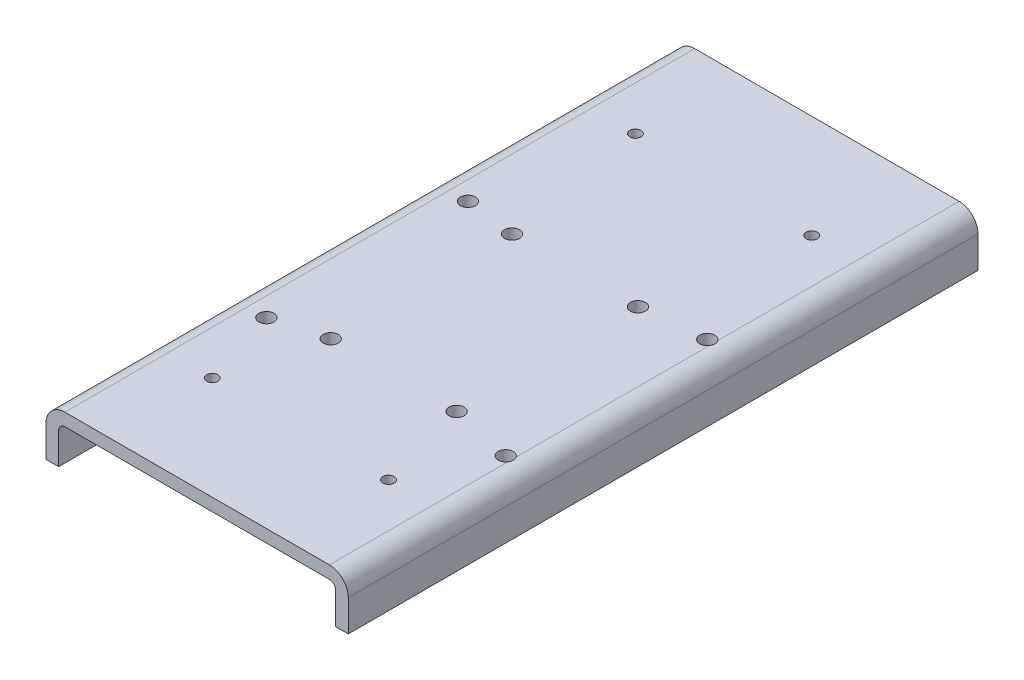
ISO-10303-21;
HEADER;
FILE_DESCRIPTION(('STEP AP214'),'2;1');
FILE_NAME('part.step','',(''),(''),'','','');
FILE_SCHEMA(('AUTOMOTIVE_DESIGN { 1 0 10303 214 1 1 1 1 }'));
ENDSEC;
DATA;
#1=APPLICATION_CONTEXT('core data for automotive mechanical design processes');
#2=APPLICATION_PROTOCOL_DEFINITION('international standard','automotive_design',2000,#1);
#3=PRODUCT_CONTEXT('',#1,'mechanical');
#4=PRODUCT('Part','Part','',(#3));
#5=PRODUCT_RELATED_PRODUCT_CATEGORY('part','',(#4));
#6=PRODUCT_DEFINITION_FORMATION('','',#4);
#7=PRODUCT_DEFINITION_CONTEXT('part definition',#1,'design');
#8=PRODUCT_DEFINITION('design','',#6,#7);
#9=PRODUCT_DEFINITION_SHAPE('','',#8);
#10=(LENGTH_UNIT() NAMED_UNIT(*) SI_UNIT(.MILLI.,.METRE.));
#11=(NAMED_UNIT(*) PLANE_ANGLE_UNIT() SI_UNIT($,.RADIAN.));
#12=(NAMED_UNIT(*) SI_UNIT($,.STERADIAN.) SOLID_ANGLE_UNIT());
#13=UNCERTAINTY_MEASURE_WITH_UNIT(LENGTH_MEASURE(1.E-05),#10,'distance_accuracy_value','');
#14=(GEOMETRIC_REPRESENTATION_CONTEXT(3) GLOBAL_UNCERTAINTY_ASSIGNED_CONTEXT((#13)) GLOBAL_UNIT_ASSIGNED_CONTEXT((#10,
#11,#12)) REPRESENTATION_CONTEXT('',''));
#15=CARTESIAN_POINT('',(0.,0.,0.));
#16=DIRECTION('',(0.,0.,1.));
#17=DIRECTION('',(1.,0.,0.));
#18=AXIS2_PLACEMENT_3D('',#15,#16,#17);
#19=CARTESIAN_POINT('',(0.,25.,500.));
#20=DIRECTION('',(1.,0.,0.));
#21=DIRECTION('',(0.,1.,0.));
#22=AXIS2_PLACEMENT_3D('',#19,#20,#21);
#23=PLANE('',#22);
#24=DIRECTION('',(0.,-1.,0.));
#25=VECTOR('',#24,1.);
#26=CARTESIAN_POINT('',(0.,25.,0.));
#27=LINE('',#26,#25);
#28=CARTESIAN_POINT('',(0.,25.,0.));
#29=VERTEX_POINT('',#28);
#30=CARTESIAN_POINT('',(0.,0.,0.));
#31=VERTEX_POINT('',#30);
#32=EDGE_CURVE('E218',#29,#31,#27,.T.);
#33=ORIENTED_EDGE('',*,*,#32,.T.);
#34=DIRECTION('',(0.,0.,-1.));
#35=VECTOR('',#34,1.);
#36=CARTESIAN_POINT('',(0.,0.,500.));
#37=LINE('',#36,#35);
#38=CARTESIAN_POINT('',(0.,0.,500.));
#39=VERTEX_POINT('',#38);
#40=EDGE_CURVE('E364',#39,#31,#37,.T.);
#41=ORIENTED_EDGE('',*,*,#40,.F.);
#42=DIRECTION('',(0.,-1.,0.));
#43=VECTOR('',#42,1.);
#44=CARTESIAN_POINT('',(0.,25.,500.));
#45=LINE('',#44,#43);
#46=CARTESIAN_POINT('',(0.,25.,500.));
#47=VERTEX_POINT('',#46);
#48=EDGE_CURVE('E192',#47,#39,#45,.T.);
#49=ORIENTED_EDGE('',*,*,#48,.F.);
#50=DIRECTION('',(0.,0.,-1.));
#51=VECTOR('',#50,1.);
#52=CARTESIAN_POINT('',(0.,25.,500.));
#53=LINE('',#52,#51);
#54=EDGE_CURVE('E164',#47,#29,#53,.T.);
#55=ORIENTED_EDGE('',*,*,#54,.T.);
#56=EDGE_LOOP('',(#33,#41,#49,#55));
#57=FACE_BOUND('',#56,.T.);
#58=ADVANCED_FACE('F24',(#57),#23,.F.);
#59=CARTESIAN_POINT('',(0.,0.,500.));
#60=DIRECTION('',(0.,1.,0.));
#61=DIRECTION('',(0.,0.,1.));
#62=AXIS2_PLACEMENT_3D('',#59,#60,#61);
#63=PLANE('',#62);
#64=DIRECTION('',(1.,0.,0.));
#65=VECTOR('',#64,1.);
#66=CARTESIAN_POINT('',(0.,0.,0.));
#67=LINE('',#66,#65);
#68=CARTESIAN_POINT('',(10.,0.,0.));
#69=VERTEX_POINT('',#68);
#70=EDGE_CURVE('E216',#31,#69,#67,.T.);
#71=ORIENTED_EDGE('',*,*,#70,.T.);
#72=DIRECTION('',(0.,0.,-1.));
#73=VECTOR('',#72,1.);
#74=CARTESIAN_POINT('',(10.,0.,500.));
#75=LINE('',#74,#73);
#76=CARTESIAN_POINT('',(10.,0.,500.));
#77=VERTEX_POINT('',#76);
#78=EDGE_CURVE('E410',#77,#69,#75,.T.);
#79=ORIENTED_EDGE('',*,*,#78,.F.);
#80=DIRECTION('',(1.,0.,0.));
#81=VECTOR('',#80,1.);
#82=CARTESIAN_POINT('',(0.,0.,500.));
#83=LINE('',#82,#81);
#84=EDGE_CURVE('E190',#39,#77,#83,.T.);
#85=ORIENTED_EDGE('',*,*,#84,.F.);
#86=ORIENTED_EDGE('',*,*,#40,.T.);
#87=EDGE_LOOP('',(#71,#79,#85,#86));
#88=FACE_BOUND('',#87,.T.);
#89=ADVANCED_FACE('F335',(#88),#63,.F.);
#90=CARTESIAN_POINT('',(10.,0.,500.));
#91=DIRECTION('',(-1.,0.,0.));
#92=DIRECTION('',(0.,0.,1.));
#93=AXIS2_PLACEMENT_3D('',#90,#91,#92);
#94=PLANE('',#93);
#95=DIRECTION('',(0.,1.,0.));
#96=VECTOR('',#95,1.);
#97=CARTESIAN_POINT('',(10.,0.,0.));
#98=LINE('',#97,#96);
#99=CARTESIAN_POINT('',(10.,25.,0.));
#100=VERTEX_POINT('',#99);
#101=EDGE_CURVE('E214',#69,#100,#98,.T.);
#102=ORIENTED_EDGE('',*,*,#101,.T.);
#103=DIRECTION('',(0.,0.,-1.));
#104=VECTOR('',#103,1.);
#105=CARTESIAN_POINT('',(10.,25.,500.));
#106=LINE('',#105,#104);
#107=CARTESIAN_POINT('',(10.,25.,500.));
#108=VERTEX_POINT('',#107);
#109=EDGE_CURVE('E407',#108,#100,#106,.T.);
#110=ORIENTED_EDGE('',*,*,#109,.F.);
#111=DIRECTION('',(0.,1.,0.));
#112=VECTOR('',#111,1.);
#113=CARTESIAN_POINT('',(10.,0.,500.));
#114=LINE('',#113,#112);
#115=EDGE_CURVE('E188',#77,#108,#114,.T.);
#116=ORIENTED_EDGE('',*,*,#115,.F.);
#117=ORIENTED_EDGE('',*,*,#78,.T.);
#118=EDGE_LOOP('',(#102,#110,#116,#117));
#119=FACE_BOUND('',#118,.T.);
#120=ADVANCED_FACE('F341',(#119),#94,.F.);
#121=CARTESIAN_POINT('',(15.,25.,500.));
#122=DIRECTION('',(0.,0.,-1.));
#123=DIRECTION('',(-1.,0.,0.));
#124=AXIS2_PLACEMENT_3D('',#121,#122,#123);
#125=CYLINDRICAL_SURFACE('',#124,5.);
#126=CARTESIAN_POINT('',(15.,25.,0.));
#127=DIRECTION('',(0.,0.,-1.));
#128=DIRECTION('',(1.,0.,0.));
#129=AXIS2_PLACEMENT_3D('',#126,#127,#128);
#130=CIRCLE('',#129,5.);
#131=CARTESIAN_POINT('',(15.,30.,0.));
#132=VERTEX_POINT('',#131);
#133=EDGE_CURVE('E212',#100,#132,#130,.T.);
#134=ORIENTED_EDGE('',*,*,#133,.T.);
#135=DIRECTION('',(0.,0.,-1.));
#136=VECTOR('',#135,1.);
#137=CARTESIAN_POINT('',(15.,30.,500.));
#138=LINE('',#137,#136);
#139=CARTESIAN_POINT('',(15.,30.,500.));
#140=VERTEX_POINT('',#139);
#141=EDGE_CURVE('E403',#140,#132,#138,.T.);
#142=ORIENTED_EDGE('',*,*,#141,.F.);
#143=CARTESIAN_POINT('',(15.,25.,500.));
#144=DIRECTION('',(0.,0.,-1.));
#145=DIRECTION('',(1.,0.,0.));
#146=AXIS2_PLACEMENT_3D('',#143,#144,#145);
#147=CIRCLE('',#146,5.);
#148=EDGE_CURVE('E186',#108,#140,#147,.T.);
#149=ORIENTED_EDGE('',*,*,#148,.F.);
#150=ORIENTED_EDGE('',*,*,#109,.T.);
#151=EDGE_LOOP('',(#134,#142,#149,#150));
#152=FACE_BOUND('',#151,.T.);
#153=ADVANCED_FACE('F422',(#152),#125,.F.);
#154=CARTESIAN_POINT('',(15.,30.,500.));
#155=DIRECTION('',(0.,1.,0.));
#156=DIRECTION('',(0.,0.,1.));
#157=AXIS2_PLACEMENT_3D('',#154,#155,#156);
#158=PLANE('',#157);
#159=CARTESIAN_POINT('',(190.000000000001,30.,417.999999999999));
#160=DIRECTION('',(0.,1.,0.));
#161=DIRECTION('',(0.,0.,1.));
#162=AXIS2_PLACEMENT_3D('',#159,#160,#161);
#163=CIRCLE('',#162,4.49999999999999);
#164=CARTESIAN_POINT('',(190.000000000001,30.,422.499999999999));
#165=VERTEX_POINT('',#164);
#166=EDGE_CURVE('E573',#165,#165,#163,.T.);
#167=ORIENTED_EDGE('',*,*,#166,.T.);
#168=EDGE_LOOP('',(#167));
#169=FACE_BOUND('',#168,.T.);
#170=CARTESIAN_POINT('',(50.0000000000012,30.,418.));
#171=DIRECTION('',(0.,1.,0.));
#172=DIRECTION('',(0.,0.,1.));
#173=AXIS2_PLACEMENT_3D('',#170,#171,#172);
#174=CIRCLE('',#173,4.5);
#175=CARTESIAN_POINT('',(50.0000000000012,30.,422.5));
#176=VERTEX_POINT('',#175);
#177=EDGE_CURVE('E577',#176,#176,#174,.T.);
#178=ORIENTED_EDGE('',*,*,#177,.T.);
#179=EDGE_LOOP('',(#178));
#180=FACE_BOUND('',#179,.T.);
#181=CARTESIAN_POINT('',(190.,30.,81.999999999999));
#182=DIRECTION('',(0.,1.,0.));
#183=DIRECTION('',(0.,0.,1.));
#184=AXIS2_PLACEMENT_3D('',#181,#182,#183);
#185=CIRCLE('',#184,4.49999999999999);
#186=CARTESIAN_POINT('',(190.,30.,86.499999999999));
#187=VERTEX_POINT('',#186);
#188=EDGE_CURVE('E581',#187,#187,#185,.T.);
#189=ORIENTED_EDGE('',*,*,#188,.T.);
#190=EDGE_LOOP('',(#189));
#191=FACE_BOUND('',#190,.T.);
#192=CARTESIAN_POINT('',(50.,30.,82.));
#193=DIRECTION('',(0.,1.,0.));
#194=DIRECTION('',(0.,0.,1.));
#195=AXIS2_PLACEMENT_3D('',#192,#193,#194);
#196=CIRCLE('',#195,4.5);
#197=CARTESIAN_POINT('',(50.,30.,86.5));
#198=VERTEX_POINT('',#197);
#199=EDGE_CURVE('E146',#198,#198,#196,.T.);
#200=ORIENTED_EDGE('',*,*,#199,.T.);
#201=EDGE_LOOP('',(#200));
#202=FACE_BOUND('',#201,.T.);
#203=CARTESIAN_POINT('',(30.,30.,355.));
#204=DIRECTION('',(0.,1.,0.));
#205=DIRECTION('',(0.,0.,1.));
#206=AXIS2_PLACEMENT_3D('',#203,#204,#205);
#207=CIRCLE('',#206,5.99999999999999);
#208=CARTESIAN_POINT('',(30.,30.,361.));
#209=VERTEX_POINT('',#208);
#210=EDGE_CURVE('E546',#209,#209,#207,.T.);
#211=ORIENTED_EDGE('',*,*,#210,.T.);
#212=EDGE_LOOP('',(#211));
#213=FACE_BOUND('',#212,.T.);
#214=CARTESIAN_POINT('',(30.,30.,195.));
#215=DIRECTION('',(0.,1.,0.));
#216=DIRECTION('',(0.,0.,1.));
#217=AXIS2_PLACEMENT_3D('',#214,#215,#216);
#218=CIRCLE('',#217,5.99999999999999);
#219=CARTESIAN_POINT('',(30.,30.,201.));
#220=VERTEX_POINT('',#219);
#221=EDGE_CURVE('E233',#220,#220,#218,.T.);
#222=ORIENTED_EDGE('',*,*,#221,.T.);
#223=EDGE_LOOP('',(#222));
#224=FACE_BOUND('',#223,.T.);
#225=CARTESIAN_POINT('',(70.,30.,200.));
#226=DIRECTION('',(0.,1.,0.));
#227=DIRECTION('',(0.,0.,1.));
#228=AXIS2_PLACEMENT_3D('',#225,#226,#227);
#229=CIRCLE('',#228,6.00000000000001);
#230=CARTESIAN_POINT('',(70.,30.,206.));
#231=VERTEX_POINT('',#230);
#232=EDGE_CURVE('E227',#231,#231,#229,.T.);
#233=ORIENTED_EDGE('',*,*,#232,.T.);
#234=EDGE_LOOP('',(#233));
#235=FACE_BOUND('',#234,.T.);
#236=CARTESIAN_POINT('',(170.,30.,200.));
#237=DIRECTION('',(0.,1.,0.));
#238=DIRECTION('',(0.,0.,1.));
#239=AXIS2_PLACEMENT_3D('',#236,#237,#238);
#240=CIRCLE('',#239,6.00000000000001);
#241=CARTESIAN_POINT('',(170.,30.,206.));
#242=VERTEX_POINT('',#241);
#243=EDGE_CURVE('E221',#242,#242,#240,.T.);
#244=ORIENTED_EDGE('',*,*,#243,.T.);
#245=EDGE_LOOP('',(#244));
#246=FACE_BOUND('',#245,.T.);
#247=DIRECTION('',(0.,0.,-1.));
#248=VECTOR('',#247,1.);
#249=CARTESIAN_POINT('',(225.,30.,500.));
#250=LINE('',#249,#248);
#251=CARTESIAN_POINT('',(225.,30.,351.683375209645));
#252=VERTEX_POINT('',#251);
#253=CARTESIAN_POINT('',(225.,30.,198.316624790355));
#254=VERTEX_POINT('',#253);
#255=EDGE_CURVE('E404',#252,#254,#250,.T.);
#256=ORIENTED_EDGE('',*,*,#255,.F.);
#257=CARTESIAN_POINT('',(220.,30.,355.));
#258=DIRECTION('',(0.,1.,0.));
#259=DIRECTION('',(0.,0.,1.));
#260=AXIS2_PLACEMENT_3D('',#257,#258,#259);
#261=CIRCLE('',#260,6.00000000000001);
#262=CARTESIAN_POINT('',(225.,30.,358.316624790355));
#263=VERTEX_POINT('',#262);
#264=EDGE_CURVE('E38',#252,#263,#261,.T.);
#265=ORIENTED_EDGE('',*,*,#264,.T.);
#266=CARTESIAN_POINT('',(225.,30.,500.));
#267=VERTEX_POINT('',#266);
#268=EDGE_CURVE('E400',#267,#263,#250,.T.);
#269=ORIENTED_EDGE('',*,*,#268,.F.);
#270=DIRECTION('',(1.,0.,0.));
#271=VECTOR('',#270,1.);
#272=CARTESIAN_POINT('',(15.,30.,500.));
#273=LINE('',#272,#271);
#274=EDGE_CURVE('E184',#140,#267,#273,.T.);
#275=ORIENTED_EDGE('',*,*,#274,.F.);
#276=ORIENTED_EDGE('',*,*,#141,.T.);
#277=DIRECTION('',(1.,0.,0.));
#278=VECTOR('',#277,1.);
#279=CARTESIAN_POINT('',(15.,30.,0.));
#280=LINE('',#279,#278);
#281=CARTESIAN_POINT('',(225.,30.,0.));
#282=VERTEX_POINT('',#281);
#283=EDGE_CURVE('E209',#132,#282,#280,.T.);
#284=ORIENTED_EDGE('',*,*,#283,.T.);
#285=CARTESIAN_POINT('',(225.,30.,191.683375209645));
#286=VERTEX_POINT('',#285);
#287=EDGE_CURVE('E396',#286,#282,#250,.T.);
#288=ORIENTED_EDGE('',*,*,#287,.F.);
#289=CARTESIAN_POINT('',(220.,30.,195.));
#290=DIRECTION('',(0.,1.,0.));
#291=DIRECTION('',(0.,0.,1.));
#292=AXIS2_PLACEMENT_3D('',#289,#290,#291);
#293=CIRCLE('',#292,6.00000000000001);
#294=EDGE_CURVE('E239',#286,#254,#293,.T.);
#295=ORIENTED_EDGE('',*,*,#294,.T.);
#296=EDGE_LOOP('',(#256,#265,#269,#275,#276,#284,#288,#295));
#297=FACE_BOUND('',#296,.T.);
#298=CARTESIAN_POINT('',(170.,30.,344.));
#299=DIRECTION('',(0.,1.,0.));
#300=DIRECTION('',(0.,0.,1.));
#301=AXIS2_PLACEMENT_3D('',#298,#299,#300);
#302=CIRCLE('',#301,6.00000000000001);
#303=CARTESIAN_POINT('',(170.,30.,350.));
#304=VERTEX_POINT('',#303);
#305=EDGE_CURVE('E357',#304,#304,#302,.T.);
#306=ORIENTED_EDGE('',*,*,#305,.T.);
#307=EDGE_LOOP('',(#306));
#308=FACE_BOUND('',#307,.T.);
#309=CARTESIAN_POINT('',(70.,30.,344.));
#310=DIRECTION('',(0.,1.,0.));
#311=DIRECTION('',(0.,0.,1.));
#312=AXIS2_PLACEMENT_3D('',#309,#310,#311);
#313=CIRCLE('',#312,6.00000000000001);
#314=CARTESIAN_POINT('',(70.,30.,350.));
#315=VERTEX_POINT('',#314);
#316=EDGE_CURVE('E362',#315,#315,#313,.T.);
#317=ORIENTED_EDGE('',*,*,#316,.T.);
#318=EDGE_LOOP('',(#317));
#319=FACE_BOUND('',#318,.T.);
#320=ADVANCED_FACE('F430',(#169,#180,#191,#202,#213,#224,#235,#246,#297,#308,#319),#158,.F.);
#321=CARTESIAN_POINT('',(225.,25.,500.));
#322=DIRECTION('',(0.,0.,-1.));
#323=DIRECTION('',(-1.,0.,0.));
#324=AXIS2_PLACEMENT_3D('',#321,#322,#323);
#325=CYLINDRICAL_SURFACE('',#324,5.);
#326=ORIENTED_EDGE('',*,*,#268,.T.);
#327=CARTESIAN_POINT('',(225.,30.,358.316624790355));
#328=CARTESIAN_POINT('',(225.092810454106,29.9999685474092,358.176739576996));
#329=CARTESIAN_POINT('',(225.179696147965,29.9974149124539,358.032978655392));
#330=CARTESIAN_POINT('',(225.341074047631,29.9890158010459,357.738797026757));
#331=CARTESIAN_POINT('',(225.415569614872,29.9831712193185,357.588378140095));
#332=CARTESIAN_POINT('',(225.551676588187,29.969940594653,357.281889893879));
#333=CARTESIAN_POINT('',(225.613287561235,29.9625544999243,357.125820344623));
#334=CARTESIAN_POINT('',(225.723231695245,29.9477288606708,356.809066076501));
#335=CARTESIAN_POINT('',(225.771564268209,29.9402893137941,356.648381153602));
#336=CARTESIAN_POINT('',(225.854622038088,29.926600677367,356.323451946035));
#337=CARTESIAN_POINT('',(225.88934502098,29.920351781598,356.159207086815));
#338=CARTESIAN_POINT('',(225.944916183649,29.9099831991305,355.82831945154));
#339=CARTESIAN_POINT('',(225.965764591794,29.9058634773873,355.661676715));
#340=CARTESIAN_POINT('',(225.993415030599,29.9003394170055,355.327273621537));
#341=CARTESIAN_POINT('',(226.000224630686,29.8989336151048,355.15951391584));
#342=CARTESIAN_POINT('',(225.999764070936,29.8990276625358,354.824019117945));
#343=CARTESIAN_POINT('',(225.992494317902,29.9005274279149,354.656284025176));
#344=CARTESIAN_POINT('',(225.964060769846,29.9061994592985,354.323523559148));
#345=CARTESIAN_POINT('',(225.943019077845,29.910348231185,354.158487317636));
#346=CARTESIAN_POINT('',(225.887321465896,29.9207175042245,353.830780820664));
#347=CARTESIAN_POINT('',(225.852664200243,29.9269382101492,353.66811080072));
#348=CARTESIAN_POINT('',(225.769999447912,29.9405317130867,353.34630889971));
#349=CARTESIAN_POINT('',(225.721996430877,29.947904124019,353.187175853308));
#350=CARTESIAN_POINT('',(225.612978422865,29.9625873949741,352.873491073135));
#351=CARTESIAN_POINT('',(225.551967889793,29.9698982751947,352.718937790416));
#352=CARTESIAN_POINT('',(225.416403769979,29.9831041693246,352.413328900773));
#353=CARTESIAN_POINT('',(225.341679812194,29.9889789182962,352.262347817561));
#354=CARTESIAN_POINT('',(225.179934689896,29.9974077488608,351.967415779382));
#355=CARTESIAN_POINT('',(225.092937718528,29.999968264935,351.823451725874));
#356=CARTESIAN_POINT('',(225.,30.,351.683375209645));
#357=B_SPLINE_CURVE_WITH_KNOTS('',3,(#327,#328,#329,#330,#331,#332,#333,#334,#335,#336,#337,
#338,#339,#340,#341,#342,#343,#344,#345,#346,#347,#348,#349,#350,#351,#352,#353,#354,#355,#356),
.UNSPECIFIED.,.F.,.F.,(4,2,2,2,2,2,2,2,2,2,2,2,2,2,4),(0.,0.503392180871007,1.00664756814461,
1.50991986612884,2.01321444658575,2.51659086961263,3.01995900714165,3.52305566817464,
4.02613779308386,4.52481889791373,5.02354930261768,5.52211287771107,6.02050586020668,
6.52557099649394,7.02965408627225),.UNSPECIFIED.);
#358=EDGE_CURVE('E145',#263,#252,#357,.T.);
#359=ORIENTED_EDGE('',*,*,#358,.T.);
#360=ORIENTED_EDGE('',*,*,#255,.T.);
#361=CARTESIAN_POINT('',(225.,30.,198.316624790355));
#362=CARTESIAN_POINT('',(225.092810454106,29.9999685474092,198.176739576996));
#363=CARTESIAN_POINT('',(225.179696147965,29.9974149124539,198.032978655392));
#364=CARTESIAN_POINT('',(225.341074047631,29.9890158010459,197.738797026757));
#365=CARTESIAN_POINT('',(225.415569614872,29.9831712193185,197.588378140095));
#366=CARTESIAN_POINT('',(225.551676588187,29.969940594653,197.281889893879));
#367=CARTESIAN_POINT('',(225.613287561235,29.9625544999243,197.125820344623));
#368=CARTESIAN_POINT('',(225.723231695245,29.9477288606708,196.809066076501));
#369=CARTESIAN_POINT('',(225.771564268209,29.9402893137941,196.648381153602));
#370=CARTESIAN_POINT('',(225.854622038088,29.926600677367,196.323451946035));
#371=CARTESIAN_POINT('',(225.88934502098,29.920351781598,196.159207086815));
#372=CARTESIAN_POINT('',(225.944916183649,29.9099831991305,195.82831945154));
#373=CARTESIAN_POINT('',(225.965764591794,29.9058634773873,195.661676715));
#374=CARTESIAN_POINT('',(225.993415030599,29.9003394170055,195.327273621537));
#375=CARTESIAN_POINT('',(226.000224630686,29.8989336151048,195.15951391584));
#376=CARTESIAN_POINT('',(225.999764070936,29.8990276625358,194.824019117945));
#377=CARTESIAN_POINT('',(225.992494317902,29.9005274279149,194.656284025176));
#378=CARTESIAN_POINT('',(225.964060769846,29.9061994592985,194.323523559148));
#379=CARTESIAN_POINT('',(225.943019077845,29.910348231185,194.158487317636));
#380=CARTESIAN_POINT('',(225.887321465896,29.9207175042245,193.830780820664));
#381=CARTESIAN_POINT('',(225.852664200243,29.9269382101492,193.66811080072));
#382=CARTESIAN_POINT('',(225.769999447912,29.9405317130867,193.34630889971));
#383=CARTESIAN_POINT('',(225.721996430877,29.947904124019,193.187175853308));
#384=CARTESIAN_POINT('',(225.612978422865,29.9625873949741,192.873491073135));
#385=CARTESIAN_POINT('',(225.551967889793,29.9698982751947,192.718937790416));
#386=CARTESIAN_POINT('',(225.416403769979,29.9831041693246,192.413328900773));
#387=CARTESIAN_POINT('',(225.341679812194,29.9889789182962,192.262347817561));
#388=CARTESIAN_POINT('',(225.179934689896,29.9974077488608,191.967415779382));
#389=CARTESIAN_POINT('',(225.092937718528,29.999968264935,191.823451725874));
#390=CARTESIAN_POINT('',(225.,30.,191.683375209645));
#391=B_SPLINE_CURVE_WITH_KNOTS('',3,(#361,#362,#363,#364,#365,#366,#367,#368,#369,#370,#371,
#372,#373,#374,#375,#376,#377,#378,#379,#380,#381,#382,#383,#384,#385,#386,#387,#388,#389,#390),
.UNSPECIFIED.,.F.,.F.,(4,2,2,2,2,2,2,2,2,2,2,2,2,2,4),(0.,0.503392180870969,1.00664756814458,
1.50991986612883,2.01321444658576,2.51659086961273,3.01995900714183,3.52305566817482,
4.02613779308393,4.52481889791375,5.02354930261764,5.52211287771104,6.02050586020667,
6.52557099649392,7.02965408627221),.UNSPECIFIED.);
#392=EDGE_CURVE('E242',#254,#286,#391,.T.);
#393=ORIENTED_EDGE('',*,*,#392,.T.);
#394=ORIENTED_EDGE('',*,*,#287,.T.);
#395=CARTESIAN_POINT('',(225.,25.,0.));
#396=DIRECTION('',(0.,0.,-1.));
#397=DIRECTION('',(-1.,0.,0.));
#398=AXIS2_PLACEMENT_3D('',#395,#396,#397);
#399=CIRCLE('',#398,5.);
#400=CARTESIAN_POINT('',(230.,25.,0.));
#401=VERTEX_POINT('',#400);
#402=EDGE_CURVE('E207',#282,#401,#399,.T.);
#403=ORIENTED_EDGE('',*,*,#402,.T.);
#404=DIRECTION('',(0.,0.,-1.));
#405=VECTOR('',#404,1.);
#406=CARTESIAN_POINT('',(230.,25.,500.));
#407=LINE('',#406,#405);
#408=CARTESIAN_POINT('',(230.,25.,500.));
#409=VERTEX_POINT('',#408);
#410=EDGE_CURVE('E393',#409,#401,#407,.T.);
#411=ORIENTED_EDGE('',*,*,#410,.F.);
#412=CARTESIAN_POINT('',(225.,25.,500.));
#413=DIRECTION('',(0.,0.,-1.));
#414=DIRECTION('',(-1.,0.,0.));
#415=AXIS2_PLACEMENT_3D('',#412,#413,#414);
#416=CIRCLE('',#415,5.);
#417=EDGE_CURVE('E182',#267,#409,#416,.T.);
#418=ORIENTED_EDGE('',*,*,#417,.F.);
#419=EDGE_LOOP('',(#326,#359,#360,#393,#394,#403,#411,#418));
#420=FACE_BOUND('',#419,.T.);
#421=ADVANCED_FACE('F256',(#420),#325,.F.);
#422=CARTESIAN_POINT('',(230.,25.,500.));
#423=DIRECTION('',(1.,0.,0.));
#424=DIRECTION('',(0.,0.,-1.));
#425=AXIS2_PLACEMENT_3D('',#422,#423,#424);
#426=PLANE('',#425);
#427=DIRECTION('',(0.,-1.,0.));
#428=VECTOR('',#427,1.);
#429=CARTESIAN_POINT('',(230.,25.,0.));
#430=LINE('',#429,#428);
#431=CARTESIAN_POINT('',(230.,0.,0.));
#432=VERTEX_POINT('',#431);
#433=EDGE_CURVE('E205',#401,#432,#430,.T.);
#434=ORIENTED_EDGE('',*,*,#433,.T.);
#435=DIRECTION('',(0.,0.,-1.));
#436=VECTOR('',#435,1.);
#437=CARTESIAN_POINT('',(230.,0.,500.));
#438=LINE('',#437,#436);
#439=CARTESIAN_POINT('',(230.,0.,500.));
#440=VERTEX_POINT('',#439);
#441=EDGE_CURVE('E390',#440,#432,#438,.T.);
#442=ORIENTED_EDGE('',*,*,#441,.F.);
#443=DIRECTION('',(0.,-1.,0.));
#444=VECTOR('',#443,1.);
#445=CARTESIAN_POINT('',(230.,25.,500.));
#446=LINE('',#445,#444);
#447=EDGE_CURVE('E180',#409,#440,#446,.T.);
#448=ORIENTED_EDGE('',*,*,#447,.F.);
#449=ORIENTED_EDGE('',*,*,#410,.T.);
#450=EDGE_LOOP('',(#434,#442,#448,#449));
#451=FACE_BOUND('',#450,.T.);
#452=ADVANCED_FACE('F432',(#451),#426,.F.);
#453=CARTESIAN_POINT('',(230.,0.,500.));
#454=DIRECTION('',(0.,1.,0.));
#455=DIRECTION('',(0.,0.,1.));
#456=AXIS2_PLACEMENT_3D('',#453,#454,#455);
#457=PLANE('',#456);
#458=DIRECTION('',(1.,0.,0.));
#459=VECTOR('',#458,1.);
#460=CARTESIAN_POINT('',(230.,0.,0.));
#461=LINE('',#460,#459);
#462=CARTESIAN_POINT('',(240.,0.,0.));
#463=VERTEX_POINT('',#462);
#464=EDGE_CURVE('E203',#432,#463,#461,.T.);
#465=ORIENTED_EDGE('',*,*,#464,.T.);
#466=DIRECTION('',(0.,0.,-1.));
#467=VECTOR('',#466,1.);
#468=CARTESIAN_POINT('',(240.,0.,500.));
#469=LINE('',#468,#467);
#470=CARTESIAN_POINT('',(240.,0.,500.));
#471=VERTEX_POINT('',#470);
#472=EDGE_CURVE('E156',#471,#463,#469,.T.);
#473=ORIENTED_EDGE('',*,*,#472,.F.);
#474=DIRECTION('',(1.,0.,0.));
#475=VECTOR('',#474,1.);
#476=CARTESIAN_POINT('',(230.,0.,500.));
#477=LINE('',#476,#475);
#478=EDGE_CURVE('E178',#440,#471,#477,.T.);
#479=ORIENTED_EDGE('',*,*,#478,.F.);
#480=ORIENTED_EDGE('',*,*,#441,.T.);
#481=EDGE_LOOP('',(#465,#473,#479,#480));
#482=FACE_BOUND('',#481,.T.);
#483=ADVANCED_FACE('F388',(#482),#457,.F.);
#484=CARTESIAN_POINT('',(240.,0.,500.));
#485=DIRECTION('',(-1.,0.,0.));
#486=DIRECTION('',(0.,0.,1.));
#487=AXIS2_PLACEMENT_3D('',#484,#485,#486);
#488=PLANE('',#487);
#489=DIRECTION('',(0.,1.,0.));
#490=VECTOR('',#489,1.);
#491=CARTESIAN_POINT('',(240.,0.,0.));
#492=LINE('',#491,#490);
#493=CARTESIAN_POINT('',(240.,25.,0.));
#494=VERTEX_POINT('',#493);
#495=EDGE_CURVE('E201',#463,#494,#492,.T.);
#496=ORIENTED_EDGE('',*,*,#495,.T.);
#497=DIRECTION('',(0.,0.,-1.));
#498=VECTOR('',#497,1.);
#499=CARTESIAN_POINT('',(240.,25.,500.));
#500=LINE('',#499,#498);
#501=CARTESIAN_POINT('',(240.,25.,500.));
#502=VERTEX_POINT('',#501);
#503=EDGE_CURVE('E152',#502,#494,#500,.T.);
#504=ORIENTED_EDGE('',*,*,#503,.F.);
#505=DIRECTION('',(0.,1.,0.));
#506=VECTOR('',#505,1.);
#507=CARTESIAN_POINT('',(240.,0.,500.));
#508=LINE('',#507,#506);
#509=EDGE_CURVE('E176',#471,#502,#508,.T.);
#510=ORIENTED_EDGE('',*,*,#509,.F.);
#511=ORIENTED_EDGE('',*,*,#472,.T.);
#512=EDGE_LOOP('',(#496,#504,#510,#511));
#513=FACE_BOUND('',#512,.T.);
#514=ADVANCED_FACE('F298',(#513),#488,.F.);
#515=CARTESIAN_POINT('',(225.,25.,500.));
#516=DIRECTION('',(0.,0.,-1.));
#517=DIRECTION('',(-1.,0.,0.));
#518=AXIS2_PLACEMENT_3D('',#515,#516,#517);
#519=CYLINDRICAL_SURFACE('',#518,15.);
#520=DIRECTION('',(0.,0.,-1.));
#521=VECTOR('',#520,1.);
#522=CARTESIAN_POINT('',(225.,40.,500.));
#523=LINE('',#522,#521);
#524=CARTESIAN_POINT('',(225.,40.,351.683375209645));
#525=VERTEX_POINT('',#524);
#526=CARTESIAN_POINT('',(225.,40.,198.316624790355));
#527=VERTEX_POINT('',#526);
#528=EDGE_CURVE('E144',#525,#527,#523,.T.);
#529=ORIENTED_EDGE('',*,*,#528,.F.);
#530=CARTESIAN_POINT('',(225.,40.,351.683375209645));
#531=CARTESIAN_POINT('',(225.093258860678,39.999989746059,351.823935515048));
#532=CARTESIAN_POINT('',(225.180556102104,39.9991295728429,351.968441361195));
#533=CARTESIAN_POINT('',(225.34267327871,39.9963072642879,352.264267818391));
#534=CARTESIAN_POINT('',(225.417494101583,39.9943452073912,352.415587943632));
#535=CARTESIAN_POINT('',(225.55407042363,39.9899183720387,352.723880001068));
#536=CARTESIAN_POINT('',(225.615834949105,39.9874539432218,352.880847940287));
#537=CARTESIAN_POINT('',(225.725934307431,39.9825252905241,353.199423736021));
#538=CARTESIAN_POINT('',(225.774269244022,39.9800610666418,353.361031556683));
#539=CARTESIAN_POINT('',(225.857174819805,39.9755459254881,353.687780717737));
#540=CARTESIAN_POINT('',(225.891742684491,39.9734950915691,353.852922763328));
#541=CARTESIAN_POINT('',(225.946863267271,39.9701107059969,354.185595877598));
#542=CARTESIAN_POINT('',(225.967411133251,39.968777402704,354.353127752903));
#543=CARTESIAN_POINT('',(225.994321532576,39.9670139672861,354.689296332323));
#544=CARTESIAN_POINT('',(226.000687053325,39.9665836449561,354.857932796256));
#545=CARTESIAN_POINT('',(225.999195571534,39.9666832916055,355.195142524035));
#546=CARTESIAN_POINT('',(225.991338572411,39.9672132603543,355.363715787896));
#547=CARTESIAN_POINT('',(225.961467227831,39.9691617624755,355.699502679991));
#548=CARTESIAN_POINT('',(225.939460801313,39.970579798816,355.866717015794));
#549=CARTESIAN_POINT('',(225.881466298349,39.9741062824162,356.198635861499));
#550=CARTESIAN_POINT('',(225.845483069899,39.9762144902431,356.363341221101));
#551=CARTESIAN_POINT('',(225.759811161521,39.9808052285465,356.68905878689));
#552=CARTESIAN_POINT('',(225.710128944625,39.9832875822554,356.850072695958));
#553=CARTESIAN_POINT('',(225.597423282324,39.9882039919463,357.167297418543));
#554=CARTESIAN_POINT('',(225.534404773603,39.9906380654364,357.323509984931));
#555=CARTESIAN_POINT('',(225.398754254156,39.9948454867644,357.622811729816));
#556=CARTESIAN_POINT('',(225.326720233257,39.9966447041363,357.766171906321));
#557=CARTESIAN_POINT('',(225.171563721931,39.9992169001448,358.046403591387));
#558=CARTESIAN_POINT('',(225.088463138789,39.999991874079,358.183287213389));
#559=CARTESIAN_POINT('',(225.,40.,358.316624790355));
#560=B_SPLINE_CURVE_WITH_KNOTS('',3,(#530,#531,#532,#533,#534,#535,#536,#537,#538,#539,#540,
#541,#542,#543,#544,#545,#546,#547,#548,#549,#550,#551,#552,#553,#554,#555,#556,#557,#558,#559),
.UNSPECIFIED.,.F.,.F.,(4,2,2,2,2,2,2,2,2,2,2,2,2,2,4),(0.,0.505889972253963,1.01174393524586,
1.51724703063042,2.02274622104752,2.52834723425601,3.03412313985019,3.53979249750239,
4.04546173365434,4.5508482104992,5.05605954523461,5.56103293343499,6.06581972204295,
6.54665622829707,7.02655464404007),.UNSPECIFIED.);
#561=CARTESIAN_POINT('',(225.,40.,358.316624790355));
#562=VERTEX_POINT('',#561);
#563=EDGE_CURVE('E45',#525,#562,#560,.T.);
#564=ORIENTED_EDGE('',*,*,#563,.T.);
#565=CARTESIAN_POINT('',(225.,40.,500.));
#566=VERTEX_POINT('',#565);
#567=EDGE_CURVE('E141',#566,#562,#523,.T.);
#568=ORIENTED_EDGE('',*,*,#567,.F.);
#569=CARTESIAN_POINT('',(225.,25.,500.));
#570=DIRECTION('',(0.,0.,1.));
#571=DIRECTION('',(1.,0.,0.));
#572=AXIS2_PLACEMENT_3D('',#569,#570,#571);
#573=CIRCLE('',#572,15.);
#574=EDGE_CURVE('E174',#502,#566,#573,.T.);
#575=ORIENTED_EDGE('',*,*,#574,.F.);
#576=ORIENTED_EDGE('',*,*,#503,.T.);
#577=CARTESIAN_POINT('',(225.,25.,0.));
#578=DIRECTION('',(0.,0.,1.));
#579=DIRECTION('',(1.,0.,0.));
#580=AXIS2_PLACEMENT_3D('',#577,#578,#579);
#581=CIRCLE('',#580,15.);
#582=CARTESIAN_POINT('',(225.,40.,0.));
#583=VERTEX_POINT('',#582);
#584=EDGE_CURVE('E199',#494,#583,#581,.T.);
#585=ORIENTED_EDGE('',*,*,#584,.T.);
#586=CARTESIAN_POINT('',(225.,40.,191.683375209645));
#587=VERTEX_POINT('',#586);
#588=EDGE_CURVE('E154',#587,#583,#523,.T.);
#589=ORIENTED_EDGE('',*,*,#588,.F.);
#590=CARTESIAN_POINT('',(225.,40.,191.683375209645));
#591=CARTESIAN_POINT('',(225.093258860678,39.999989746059,191.823935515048));
#592=CARTESIAN_POINT('',(225.180556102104,39.9991295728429,191.968441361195));
#593=CARTESIAN_POINT('',(225.34267327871,39.9963072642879,192.264267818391));
#594=CARTESIAN_POINT('',(225.417494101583,39.9943452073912,192.415587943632));
#595=CARTESIAN_POINT('',(225.55407042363,39.9899183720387,192.723880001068));
#596=CARTESIAN_POINT('',(225.615834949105,39.9874539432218,192.880847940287));
#597=CARTESIAN_POINT('',(225.725934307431,39.9825252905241,193.199423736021));
#598=CARTESIAN_POINT('',(225.774269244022,39.9800610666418,193.361031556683));
#599=CARTESIAN_POINT('',(225.857174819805,39.9755459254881,193.687780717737));
#600=CARTESIAN_POINT('',(225.891742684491,39.9734950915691,193.852922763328));
#601=CARTESIAN_POINT('',(225.946863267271,39.9701107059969,194.185595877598));
#602=CARTESIAN_POINT('',(225.967411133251,39.968777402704,194.353127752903));
#603=CARTESIAN_POINT('',(225.994321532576,39.9670139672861,194.689296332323));
#604=CARTESIAN_POINT('',(226.000687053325,39.9665836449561,194.857932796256));
#605=CARTESIAN_POINT('',(225.999195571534,39.9666832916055,195.195142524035));
#606=CARTESIAN_POINT('',(225.991338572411,39.9672132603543,195.363715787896));
#607=CARTESIAN_POINT('',(225.961467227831,39.9691617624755,195.699502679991));
#608=CARTESIAN_POINT('',(225.939460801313,39.970579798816,195.866717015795));
#609=CARTESIAN_POINT('',(225.881466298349,39.9741062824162,196.198635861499));
#610=CARTESIAN_POINT('',(225.845483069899,39.9762144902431,196.363341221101));
#611=CARTESIAN_POINT('',(225.759811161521,39.9808052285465,196.68905878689));
#612=CARTESIAN_POINT('',(225.710128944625,39.9832875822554,196.850072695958));
#613=CARTESIAN_POINT('',(225.597423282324,39.9882039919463,197.167297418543));
#614=CARTESIAN_POINT('',(225.534404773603,39.9906380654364,197.323509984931));
#615=CARTESIAN_POINT('',(225.398754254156,39.9948454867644,197.622811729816));
#616=CARTESIAN_POINT('',(225.326720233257,39.9966447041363,197.766171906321));
#617=CARTESIAN_POINT('',(225.171563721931,39.9992169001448,198.046403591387));
#618=CARTESIAN_POINT('',(225.088463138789,39.999991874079,198.183287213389));
#619=CARTESIAN_POINT('',(225.,40.,198.316624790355));
#620=B_SPLINE_CURVE_WITH_KNOTS('',3,(#590,#591,#592,#593,#594,#595,#596,#597,#598,#599,#600,
#601,#602,#603,#604,#605,#606,#607,#608,#609,#610,#611,#612,#613,#614,#615,#616,#617,#618,#619),
.UNSPECIFIED.,.F.,.F.,(4,2,2,2,2,2,2,2,2,2,2,2,2,2,4),(0.,0.505889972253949,1.01174393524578,
1.5172470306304,2.02274622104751,2.528347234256,3.03412313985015,3.53979249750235,
4.04546173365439,4.55084821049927,5.05605954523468,5.56103293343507,6.065819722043,
6.5466562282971,7.02655464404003),.UNSPECIFIED.);
#621=EDGE_CURVE('E250',#587,#527,#620,.T.);
#622=ORIENTED_EDGE('',*,*,#621,.T.);
#623=EDGE_LOOP('',(#529,#564,#568,#575,#576,#585,#589,#622));
#624=FACE_BOUND('',#623,.T.);
#625=ADVANCED_FACE('F139',(#624),#519,.T.);
#626=CARTESIAN_POINT('',(225.,40.,500.));
#627=DIRECTION('',(0.,-1.,0.));
#628=DIRECTION('',(1.,0.,0.));
#629=AXIS2_PLACEMENT_3D('',#626,#627,#628);
#630=PLANE('',#629);
#631=CARTESIAN_POINT('',(190.000000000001,40.,417.999999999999));
#632=DIRECTION('',(0.,1.,0.));
#633=DIRECTION('',(-1.,0.,0.));
#634=AXIS2_PLACEMENT_3D('',#631,#632,#633);
#635=CIRCLE('',#634,4.49999999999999);
#636=CARTESIAN_POINT('',(185.500000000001,40.,417.999999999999));
#637=VERTEX_POINT('',#636);
#638=EDGE_CURVE('E598',#637,#637,#635,.T.);
#639=ORIENTED_EDGE('',*,*,#638,.F.);
#640=EDGE_LOOP('',(#639));
#641=FACE_BOUND('',#640,.T.);
#642=CARTESIAN_POINT('',(50.0000000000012,40.,418.));
#643=DIRECTION('',(0.,1.,0.));
#644=DIRECTION('',(-1.,0.,0.));
#645=AXIS2_PLACEMENT_3D('',#642,#643,#644);
#646=CIRCLE('',#645,4.5);
#647=CARTESIAN_POINT('',(45.5000000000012,40.,418.));
#648=VERTEX_POINT('',#647);
#649=EDGE_CURVE('E594',#648,#648,#646,.T.);
#650=ORIENTED_EDGE('',*,*,#649,.F.);
#651=EDGE_LOOP('',(#650));
#652=FACE_BOUND('',#651,.T.);
#653=CARTESIAN_POINT('',(190.,40.,81.999999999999));
#654=DIRECTION('',(0.,1.,0.));
#655=DIRECTION('',(-1.,0.,0.));
#656=AXIS2_PLACEMENT_3D('',#653,#654,#655);
#657=CIRCLE('',#656,4.49999999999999);
#658=CARTESIAN_POINT('',(185.5,40.,81.999999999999));
#659=VERTEX_POINT('',#658);
#660=EDGE_CURVE('E588',#659,#659,#657,.T.);
#661=ORIENTED_EDGE('',*,*,#660,.F.);
#662=EDGE_LOOP('',(#661));
#663=FACE_BOUND('',#662,.T.);
#664=CARTESIAN_POINT('',(50.,40.,82.));
#665=DIRECTION('',(0.,1.,0.));
#666=DIRECTION('',(-1.,0.,0.));
#667=AXIS2_PLACEMENT_3D('',#664,#665,#666);
#668=CIRCLE('',#667,4.5);
#669=CARTESIAN_POINT('',(45.5,40.,82.));
#670=VERTEX_POINT('',#669);
#671=EDGE_CURVE('E585',#670,#670,#668,.T.);
#672=ORIENTED_EDGE('',*,*,#671,.F.);
#673=EDGE_LOOP('',(#672));
#674=FACE_BOUND('',#673,.T.);
#675=CARTESIAN_POINT('',(30.,40.,355.));
#676=DIRECTION('',(0.,1.,0.));
#677=DIRECTION('',(0.,0.,1.));
#678=AXIS2_PLACEMENT_3D('',#675,#676,#677);
#679=CIRCLE('',#678,5.99999999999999);
#680=CARTESIAN_POINT('',(30.,40.,361.));
#681=VERTEX_POINT('',#680);
#682=EDGE_CURVE('E543',#681,#681,#679,.T.);
#683=ORIENTED_EDGE('',*,*,#682,.F.);
#684=EDGE_LOOP('',(#683));
#685=FACE_BOUND('',#684,.T.);
#686=CARTESIAN_POINT('',(30.,40.,195.));
#687=DIRECTION('',(0.,1.,0.));
#688=DIRECTION('',(0.,0.,1.));
#689=AXIS2_PLACEMENT_3D('',#686,#687,#688);
#690=CIRCLE('',#689,5.99999999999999);
#691=CARTESIAN_POINT('',(30.,40.,201.));
#692=VERTEX_POINT('',#691);
#693=EDGE_CURVE('E236',#692,#692,#690,.T.);
#694=ORIENTED_EDGE('',*,*,#693,.F.);
#695=EDGE_LOOP('',(#694));
#696=FACE_BOUND('',#695,.T.);
#697=CARTESIAN_POINT('',(70.,40.,200.));
#698=DIRECTION('',(0.,1.,0.));
#699=DIRECTION('',(0.,0.,1.));
#700=AXIS2_PLACEMENT_3D('',#697,#698,#699);
#701=CIRCLE('',#700,6.00000000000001);
#702=CARTESIAN_POINT('',(70.,40.,206.));
#703=VERTEX_POINT('',#702);
#704=EDGE_CURVE('E230',#703,#703,#701,.T.);
#705=ORIENTED_EDGE('',*,*,#704,.F.);
#706=EDGE_LOOP('',(#705));
#707=FACE_BOUND('',#706,.T.);
#708=CARTESIAN_POINT('',(170.,40.,200.));
#709=DIRECTION('',(0.,1.,0.));
#710=DIRECTION('',(0.,0.,1.));
#711=AXIS2_PLACEMENT_3D('',#708,#709,#710);
#712=CIRCLE('',#711,6.00000000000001);
#713=CARTESIAN_POINT('',(170.,40.,206.));
#714=VERTEX_POINT('',#713);
#715=EDGE_CURVE('E224',#714,#714,#712,.T.);
#716=ORIENTED_EDGE('',*,*,#715,.F.);
#717=EDGE_LOOP('',(#716));
#718=FACE_BOUND('',#717,.T.);
#719=ORIENTED_EDGE('',*,*,#567,.T.);
#720=CARTESIAN_POINT('',(220.,40.,355.));
#721=DIRECTION('',(0.,-1.,0.));
#722=DIRECTION('',(1.,0.,0.));
#723=AXIS2_PLACEMENT_3D('',#720,#721,#722);
#724=CIRCLE('',#723,6.00000000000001);
#725=EDGE_CURVE('E11',#562,#525,#724,.T.);
#726=ORIENTED_EDGE('',*,*,#725,.T.);
#727=ORIENTED_EDGE('',*,*,#528,.T.);
#728=CARTESIAN_POINT('',(220.,40.,195.));
#729=DIRECTION('',(0.,-1.,0.));
#730=DIRECTION('',(1.,0.,0.));
#731=AXIS2_PLACEMENT_3D('',#728,#729,#730);
#732=CIRCLE('',#731,6.00000000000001);
#733=EDGE_CURVE('E32',#527,#587,#732,.T.);
#734=ORIENTED_EDGE('',*,*,#733,.T.);
#735=ORIENTED_EDGE('',*,*,#588,.T.);
#736=DIRECTION('',(-1.,0.,0.));
#737=VECTOR('',#736,1.);
#738=CARTESIAN_POINT('',(225.,40.,0.));
#739=LINE('',#738,#737);
#740=CARTESIAN_POINT('',(15.,40.,0.));
#741=VERTEX_POINT('',#740);
#742=EDGE_CURVE('E197',#583,#741,#739,.T.);
#743=ORIENTED_EDGE('',*,*,#742,.T.);
#744=DIRECTION('',(0.,0.,-1.));
#745=VECTOR('',#744,1.);
#746=CARTESIAN_POINT('',(15.,40.,500.));
#747=LINE('',#746,#745);
#748=CARTESIAN_POINT('',(15.,40.,500.));
#749=VERTEX_POINT('',#748);
#750=EDGE_CURVE('E159',#749,#741,#747,.T.);
#751=ORIENTED_EDGE('',*,*,#750,.F.);
#752=DIRECTION('',(-1.,0.,0.));
#753=VECTOR('',#752,1.);
#754=CARTESIAN_POINT('',(225.,40.,500.));
#755=LINE('',#754,#753);
#756=EDGE_CURVE('E151',#566,#749,#755,.T.);
#757=ORIENTED_EDGE('',*,*,#756,.F.);
#758=EDGE_LOOP('',(#719,#726,#727,#734,#735,#743,#751,#757));
#759=FACE_BOUND('',#758,.T.);
#760=CARTESIAN_POINT('',(170.,40.,344.));
#761=DIRECTION('',(0.,1.,0.));
#762=DIRECTION('',(0.,0.,1.));
#763=AXIS2_PLACEMENT_3D('',#760,#761,#762);
#764=CIRCLE('',#763,6.00000000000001);
#765=CARTESIAN_POINT('',(170.,40.,350.));
#766=VERTEX_POINT('',#765);
#767=EDGE_CURVE('E354',#766,#766,#764,.T.);
#768=ORIENTED_EDGE('',*,*,#767,.F.);
#769=EDGE_LOOP('',(#768));
#770=FACE_BOUND('',#769,.T.);
#771=CARTESIAN_POINT('',(70.,40.,344.));
#772=DIRECTION('',(0.,1.,0.));
#773=DIRECTION('',(0.,0.,1.));
#774=AXIS2_PLACEMENT_3D('',#771,#772,#773);
#775=CIRCLE('',#774,6.00000000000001);
#776=CARTESIAN_POINT('',(70.,40.,350.));
#777=VERTEX_POINT('',#776);
#778=EDGE_CURVE('E359',#777,#777,#775,.T.);
#779=ORIENTED_EDGE('',*,*,#778,.F.);
#780=EDGE_LOOP('',(#779));
#781=FACE_BOUND('',#780,.T.);
#782=ADVANCED_FACE('F148',(#641,#652,#663,#674,#685,#696,#707,#718,#759,#770,#781),#630,.F.);
#783=CARTESIAN_POINT('',(15.,25.,500.));
#784=DIRECTION('',(0.,0.,-1.));
#785=DIRECTION('',(-1.,0.,0.));
#786=AXIS2_PLACEMENT_3D('',#783,#784,#785);
#787=CYLINDRICAL_SURFACE('',#786,15.);
#788=CARTESIAN_POINT('',(15.,25.,0.));
#789=DIRECTION('',(0.,0.,1.));
#790=DIRECTION('',(-1.,0.,0.));
#791=AXIS2_PLACEMENT_3D('',#788,#789,#790);
#792=CIRCLE('',#791,15.);
#793=EDGE_CURVE('E195',#741,#29,#792,.T.);
#794=ORIENTED_EDGE('',*,*,#793,.T.);
#795=ORIENTED_EDGE('',*,*,#54,.F.);
#796=CARTESIAN_POINT('',(15.,25.,500.));
#797=DIRECTION('',(0.,0.,1.));
#798=DIRECTION('',(-1.,0.,0.));
#799=AXIS2_PLACEMENT_3D('',#796,#797,#798);
#800=CIRCLE('',#799,15.);
#801=EDGE_CURVE('E169',#749,#47,#800,.T.);
#802=ORIENTED_EDGE('',*,*,#801,.F.);
#803=ORIENTED_EDGE('',*,*,#750,.T.);
#804=EDGE_LOOP('',(#794,#795,#802,#803));
#805=FACE_BOUND('',#804,.T.);
#806=ADVANCED_FACE('F289',(#805),#787,.T.);
#807=CARTESIAN_POINT('',(15.,25.,500.));
#808=DIRECTION('',(0.,0.,1.));
#809=DIRECTION('',(1.,0.,0.));
#810=AXIS2_PLACEMENT_3D('',#807,#808,#809);
#811=PLANE('',#810);
#812=ORIENTED_EDGE('',*,*,#48,.T.);
#813=ORIENTED_EDGE('',*,*,#84,.T.);
#814=ORIENTED_EDGE('',*,*,#115,.T.);
#815=ORIENTED_EDGE('',*,*,#148,.T.);
#816=ORIENTED_EDGE('',*,*,#274,.T.);
#817=ORIENTED_EDGE('',*,*,#417,.T.);
#818=ORIENTED_EDGE('',*,*,#447,.T.);
#819=ORIENTED_EDGE('',*,*,#478,.T.);
#820=ORIENTED_EDGE('',*,*,#509,.T.);
#821=ORIENTED_EDGE('',*,*,#574,.T.);
#822=ORIENTED_EDGE('',*,*,#756,.T.);
#823=ORIENTED_EDGE('',*,*,#801,.T.);
#824=EDGE_LOOP('',(#812,#813,#814,#815,#816,#817,#818,#819,#820,#821,#822,#823));
#825=FACE_BOUND('',#824,.T.);
#826=ADVANCED_FACE('F285',(#825),#811,.T.);
#827=CARTESIAN_POINT('',(15.,25.,0.));
#828=DIRECTION('',(0.,0.,1.));
#829=DIRECTION('',(1.,0.,0.));
#830=AXIS2_PLACEMENT_3D('',#827,#828,#829);
#831=PLANE('',#830);
#832=ORIENTED_EDGE('',*,*,#32,.F.);
#833=ORIENTED_EDGE('',*,*,#793,.F.);
#834=ORIENTED_EDGE('',*,*,#742,.F.);
#835=ORIENTED_EDGE('',*,*,#584,.F.);
#836=ORIENTED_EDGE('',*,*,#495,.F.);
#837=ORIENTED_EDGE('',*,*,#464,.F.);
#838=ORIENTED_EDGE('',*,*,#433,.F.);
#839=ORIENTED_EDGE('',*,*,#402,.F.);
#840=ORIENTED_EDGE('',*,*,#283,.F.);
#841=ORIENTED_EDGE('',*,*,#133,.F.);
#842=ORIENTED_EDGE('',*,*,#101,.F.);
#843=ORIENTED_EDGE('',*,*,#70,.F.);
#844=EDGE_LOOP('',(#832,#833,#834,#835,#836,#837,#838,#839,#840,#841,#842,#843));
#845=FACE_BOUND('',#844,.T.);
#846=ADVANCED_FACE('F281',(#845),#831,.F.);
#847=CARTESIAN_POINT('',(170.,40.,200.));
#848=DIRECTION('',(0.,1.,0.));
#849=DIRECTION('',(0.,0.,1.));
#850=AXIS2_PLACEMENT_3D('',#847,#848,#849);
#851=CYLINDRICAL_SURFACE('',#850,6.00000000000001);
#852=ORIENTED_EDGE('',*,*,#715,.T.);
#853=EDGE_LOOP('',(#852));
#854=FACE_BOUND('',#853,.T.);
#855=ORIENTED_EDGE('',*,*,#243,.F.);
#856=EDGE_LOOP('',(#855));
#857=FACE_BOUND('',#856,.T.);
#858=ADVANCED_FACE('F277',(#854,#857),#851,.F.);
#859=CARTESIAN_POINT('',(70.,40.,200.));
#860=DIRECTION('',(0.,1.,0.));
#861=DIRECTION('',(0.,0.,1.));
#862=AXIS2_PLACEMENT_3D('',#859,#860,#861);
#863=CYLINDRICAL_SURFACE('',#862,6.00000000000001);
#864=ORIENTED_EDGE('',*,*,#704,.T.);
#865=EDGE_LOOP('',(#864));
#866=FACE_BOUND('',#865,.T.);
#867=ORIENTED_EDGE('',*,*,#232,.F.);
#868=EDGE_LOOP('',(#867));
#869=FACE_BOUND('',#868,.T.);
#870=ADVANCED_FACE('F273',(#866,#869),#863,.F.);
#871=CARTESIAN_POINT('',(170.,40.,344.));
#872=DIRECTION('',(0.,1.,0.));
#873=DIRECTION('',(0.,0.,1.));
#874=AXIS2_PLACEMENT_3D('',#871,#872,#873);
#875=CYLINDRICAL_SURFACE('',#874,6.00000000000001);
#876=ORIENTED_EDGE('',*,*,#767,.T.);
#877=EDGE_LOOP('',(#876));
#878=FACE_BOUND('',#877,.T.);
#879=ORIENTED_EDGE('',*,*,#305,.F.);
#880=EDGE_LOOP('',(#879));
#881=FACE_BOUND('',#880,.T.);
#882=ADVANCED_FACE('F276',(#878,#881),#875,.F.);
#883=CARTESIAN_POINT('',(70.,40.,344.));
#884=DIRECTION('',(0.,1.,0.));
#885=DIRECTION('',(0.,0.,1.));
#886=AXIS2_PLACEMENT_3D('',#883,#884,#885);
#887=CYLINDRICAL_SURFACE('',#886,6.00000000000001);
#888=ORIENTED_EDGE('',*,*,#778,.T.);
#889=EDGE_LOOP('',(#888));
#890=FACE_BOUND('',#889,.T.);
#891=ORIENTED_EDGE('',*,*,#316,.F.);
#892=EDGE_LOOP('',(#891));
#893=FACE_BOUND('',#892,.T.);
#894=ADVANCED_FACE('F26',(#890,#893),#887,.F.);
#895=CARTESIAN_POINT('',(30.,40.,195.));
#896=DIRECTION('',(0.,1.,0.));
#897=DIRECTION('',(0.,0.,1.));
#898=AXIS2_PLACEMENT_3D('',#895,#896,#897);
#899=CYLINDRICAL_SURFACE('',#898,5.99999999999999);
#900=ORIENTED_EDGE('',*,*,#693,.T.);
#901=EDGE_LOOP('',(#900));
#902=FACE_BOUND('',#901,.T.);
#903=ORIENTED_EDGE('',*,*,#221,.F.);
#904=EDGE_LOOP('',(#903));
#905=FACE_BOUND('',#904,.T.);
#906=ADVANCED_FACE('F266',(#902,#905),#899,.F.);
#907=CARTESIAN_POINT('',(220.,40.,195.));
#908=DIRECTION('',(0.,1.,0.));
#909=DIRECTION('',(0.,0.,1.));
#910=AXIS2_PLACEMENT_3D('',#907,#908,#909);
#911=CYLINDRICAL_SURFACE('',#910,6.00000000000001);
#912=ORIENTED_EDGE('',*,*,#733,.F.);
#913=ORIENTED_EDGE('',*,*,#621,.F.);
#914=EDGE_LOOP('',(#912,#913));
#915=FACE_BOUND('',#914,.T.);
#916=ORIENTED_EDGE('',*,*,#392,.F.);
#917=ORIENTED_EDGE('',*,*,#294,.F.);
#918=EDGE_LOOP('',(#916,#917));
#919=FACE_BOUND('',#918,.T.);
#920=ADVANCED_FACE('F260',(#915,#919),#911,.F.);
#921=CARTESIAN_POINT('',(30.,40.,355.));
#922=DIRECTION('',(0.,1.,0.));
#923=DIRECTION('',(0.,0.,1.));
#924=AXIS2_PLACEMENT_3D('',#921,#922,#923);
#925=CYLINDRICAL_SURFACE('',#924,5.99999999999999);
#926=ORIENTED_EDGE('',*,*,#682,.T.);
#927=EDGE_LOOP('',(#926));
#928=FACE_BOUND('',#927,.T.);
#929=ORIENTED_EDGE('',*,*,#210,.F.);
#930=EDGE_LOOP('',(#929));
#931=FACE_BOUND('',#930,.T.);
#932=ADVANCED_FACE('F265',(#928,#931),#925,.F.);
#933=CARTESIAN_POINT('',(220.,40.,355.));
#934=DIRECTION('',(0.,1.,0.));
#935=DIRECTION('',(0.,0.,1.));
#936=AXIS2_PLACEMENT_3D('',#933,#934,#935);
#937=CYLINDRICAL_SURFACE('',#936,6.00000000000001);
#938=ORIENTED_EDGE('',*,*,#725,.F.);
#939=ORIENTED_EDGE('',*,*,#563,.F.);
#940=EDGE_LOOP('',(#938,#939));
#941=FACE_BOUND('',#940,.T.);
#942=ORIENTED_EDGE('',*,*,#358,.F.);
#943=ORIENTED_EDGE('',*,*,#264,.F.);
#944=EDGE_LOOP('',(#942,#943));
#945=FACE_BOUND('',#944,.T.);
#946=ADVANCED_FACE('F133',(#941,#945),#937,.F.);
#947=CARTESIAN_POINT('',(50.,0.,82.));
#948=DIRECTION('',(0.,1.,0.));
#949=DIRECTION('',(-1.,0.,0.));
#950=AXIS2_PLACEMENT_3D('',#947,#948,#949);
#951=CYLINDRICAL_SURFACE('',#950,4.5);
#952=ORIENTED_EDGE('',*,*,#671,.T.);
#953=EDGE_LOOP('',(#952));
#954=FACE_BOUND('',#953,.T.);
#955=ORIENTED_EDGE('',*,*,#199,.F.);
#956=EDGE_LOOP('',(#955));
#957=FACE_BOUND('',#956,.T.);
#958=ADVANCED_FACE('F314',(#954,#957),#951,.F.);
#959=CARTESIAN_POINT('',(190.,0.,81.999999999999));
#960=DIRECTION('',(0.,1.,0.));
#961=DIRECTION('',(-1.,0.,0.));
#962=AXIS2_PLACEMENT_3D('',#959,#960,#961);
#963=CYLINDRICAL_SURFACE('',#962,4.49999999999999);
#964=ORIENTED_EDGE('',*,*,#660,.T.);
#965=EDGE_LOOP('',(#964));
#966=FACE_BOUND('',#965,.T.);
#967=ORIENTED_EDGE('',*,*,#188,.F.);
#968=EDGE_LOOP('',(#967));
#969=FACE_BOUND('',#968,.T.);
#970=ADVANCED_FACE('F318',(#966,#969),#963,.F.);
#971=CARTESIAN_POINT('',(50.0000000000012,0.,418.));
#972=DIRECTION('',(0.,1.,0.));
#973=DIRECTION('',(-1.,0.,0.));
#974=AXIS2_PLACEMENT_3D('',#971,#972,#973);
#975=CYLINDRICAL_SURFACE('',#974,4.5);
#976=ORIENTED_EDGE('',*,*,#649,.T.);
#977=EDGE_LOOP('',(#976));
#978=FACE_BOUND('',#977,.T.);
#979=ORIENTED_EDGE('',*,*,#177,.F.);
#980=EDGE_LOOP('',(#979));
#981=FACE_BOUND('',#980,.T.);
#982=ADVANCED_FACE('F322',(#978,#981),#975,.F.);
#983=CARTESIAN_POINT('',(190.000000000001,0.,417.999999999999));
#984=DIRECTION('',(0.,1.,0.));
#985=DIRECTION('',(-1.,0.,0.));
#986=AXIS2_PLACEMENT_3D('',#983,#984,#985);
#987=CYLINDRICAL_SURFACE('',#986,4.49999999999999);
#988=ORIENTED_EDGE('',*,*,#638,.T.);
#989=EDGE_LOOP('',(#988));
#990=FACE_BOUND('',#989,.T.);
#991=ORIENTED_EDGE('',*,*,#166,.F.);
#992=EDGE_LOOP('',(#991));
#993=FACE_BOUND('',#992,.T.);
#994=ADVANCED_FACE('F326',(#990,#993),#987,.F.);
#995=CLOSED_SHELL('',(#58,#89,#120,#153,#320,#421,#452,#483,#514,#625,#782,#806,#826,#846,#858,
#870,#882,#894,#906,#920,#932,#946,#958,#970,#982,#994));
#996=MANIFOLD_SOLID_BREP('B2',#995);
#997=ADVANCED_BREP_SHAPE_REPRESENTATION('',(#18,#996),#14);
#998=SHAPE_DEFINITION_REPRESENTATION(#9,#997);
ENDSEC;
END-ISO-10303-21;
